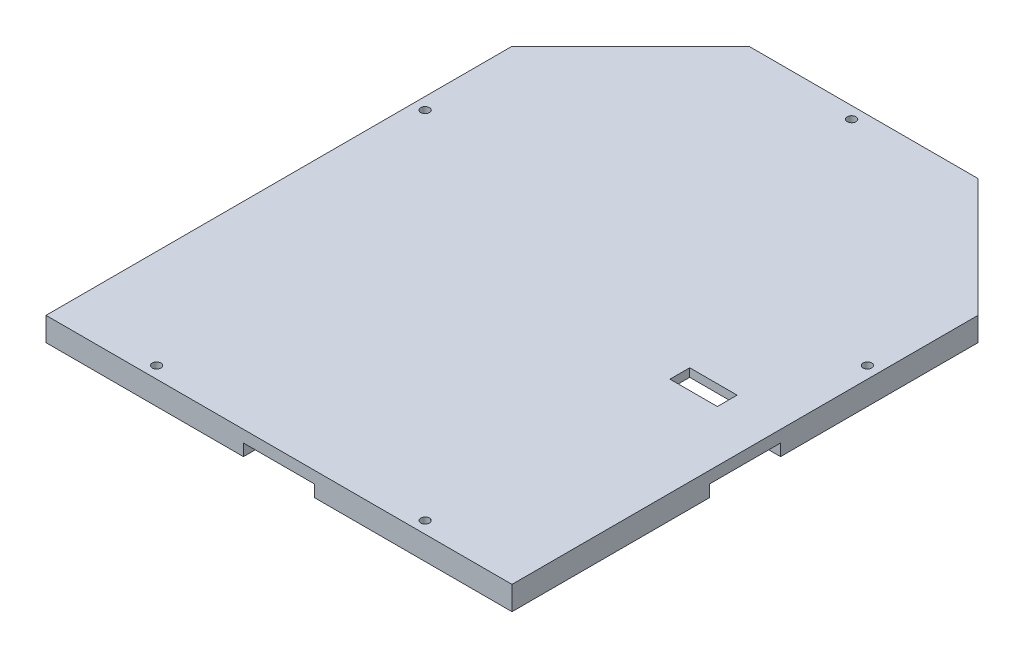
from build123d import *

# Parameters (mm, degrees)
ESQUISSE1_R             = 1.1
ESQUISSE1_W             = 12
ESQUISSE1_H             = 5
BOSS_EXTRU_1_DEPTH      = 6
ENL_V_MAT_EXTRU_1_DEPTH = 3
ENL_V_MAT_EXTRU_2_DEPTH = 2
ENL_V_MAT_EXTRU_3_DEPTH = 3.9


with BuildPart() as part:
    # Esquisse1 → Boss.-Extru.1 (new body)
    with BuildSketch(Plane(origin=(0, 0, 0), x_dir=(1, 0, 0), z_dir=(0, 1, 0))):
        Polygon((-59, 59), (-29, 89), (29, 89), (59, 59), (59, -59), (-59, -59), align=None)
        with Locations(Location((-56, 34, 0), (0, 0, 270))):
            Circle(ESQUISSE1_R, mode=Mode.SUBTRACT)
        with Locations(Location((34, -56, 0), (0, 0, 90))):
            Circle(ESQUISSE1_R, mode=Mode.SUBTRACT)
        with Locations(Location((56, 34, 0), (0, 0, 90))):
            Circle(ESQUISSE1_R, mode=Mode.SUBTRACT)
        with Locations(Location((-34, -56, 0), (0, 0, 270))):
            Circle(ESQUISSE1_R, mode=Mode.SUBTRACT)
        with Locations(Location((0, 86, 0), (0, 0, 270))):
            Circle(ESQUISSE1_R, mode=Mode.SUBTRACT)
        with Locations((40, 8.5)):
            Rectangle(ESQUISSE1_W, ESQUISSE1_H, mode=Mode.SUBTRACT)
    extrude(amount=BOSS_EXTRU_1_DEPTH)

    # Esquisse2 → Enl_v. mat.-Extru.1 (cut)
    with BuildSketch(Plane(origin=(0, 0, 0), x_dir=(1, 0, 0), z_dir=(0, 1, 0))):
        with BuildLine():
            Line((53, 6.7372583), (53, -6.7372583))
            ThreePointArc((53, -6.7372583), (53, -9), (55.2627417, -9))
            Line((55.2627417, -9), (61.024031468, -9))
            Line((61.024031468, -9), (61.024031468, 9))
            Line((61.024031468, 9), (55.2627417, 9))
            ThreePointArc((55.2627417, 9), (53, 9), (53, 6.7372583))
        make_face()
        with BuildLine():
            Line((6.7372583, -53), (-6.7372583, -53))
            ThreePointArc((-6.7372583, -53), (-9, -53), (-9, -55.2627417))
            Line((-9, -55.2627417), (-9, -61.024031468))
            Line((-9, -61.024031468), (9, -61.024031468))
            Line((9, -61.024031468), (9, -55.2627417))
            ThreePointArc((9, -55.2627417), (9, -53), (6.7372583, -53))
        make_face()
        with BuildLine():
            Line((-53, -6.7372583), (-53, 6.7372583))
            ThreePointArc((-53, 6.7372583), (-53, 9), (-55.2627417, 9))
            Line((-55.2627417, 9), (-61.024031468, 9))
            Line((-61.024031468, 9), (-61.024031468, -9))
            Line((-61.024031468, -9), (-55.2627417, -9))
            ThreePointArc((-55.2627417, -9), (-53, -9), (-53, -6.7372583))
        make_face()
    extrude(amount=ENL_V_MAT_EXTRU_1_DEPTH, mode=Mode.SUBTRACT)

    # Esquisse4 → Enl_v. mat.-Extru.2 (cut)
    with BuildSketch(Plane.XZ):
        with BuildLine():
            Line((4.969848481, 48.7), (48.030151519, 48.7))
            ThreePointArc((48.030151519, 48.7), (51, 48.7), (51, 45.730151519))
            Line((51, 45.730151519), (51, -24.8))
            Line((51, -24.8), (2, -24.8))
            Line((2, -24.8), (2, 45.730151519))
            ThreePointArc((2, 45.730151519), (2, 48.7), (4.969848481, 48.7))
        make_face()
    extrude(amount=-ENL_V_MAT_EXTRU_2_DEPTH, mode=Mode.SUBTRACT)

    # Esquisse5 → Enl_v. mat.-Extru.3 (cut)
    with BuildSketch(Plane.XZ):
        with BuildLine():
            Line((4.969848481, -14.8), (48.030151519, -14.8))
            ThreePointArc((48.030151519, -14.8), (51, -14.8), (51, -11.830151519))
            Line((51, -11.830151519), (51, 45.730151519))
            ThreePointArc((51, 45.730151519), (51, 48.7), (48.030151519, 48.7))
            Line((48.030151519, 48.7), (4.969848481, 48.7))
            ThreePointArc((4.969848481, 48.7), (2, 48.7), (2, 45.730151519))
            Line((2, 45.730151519), (2, -11.830151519))
            ThreePointArc((2, -11.830151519), (2, -14.8), (4.969848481, -14.8))
        make_face()
    extrude(amount=-ENL_V_MAT_EXTRU_3_DEPTH, mode=Mode.SUBTRACT)


solid = part.part
